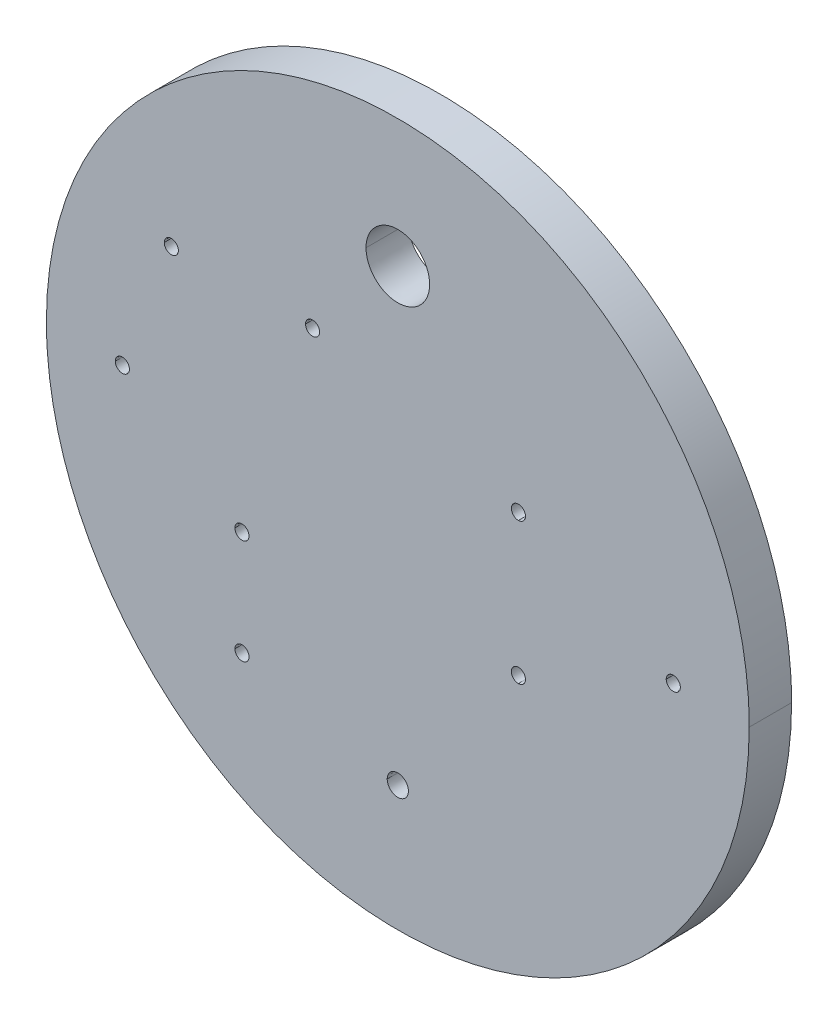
ISO-10303-21;
HEADER;
FILE_DESCRIPTION(('STEP AP214'),'2;1');
FILE_NAME('part.step','',(''),(''),'','','');
FILE_SCHEMA(('AUTOMOTIVE_DESIGN { 1 0 10303 214 1 1 1 1 }'));
ENDSEC;
DATA;
#1=APPLICATION_CONTEXT('core data for automotive mechanical design processes');
#2=APPLICATION_PROTOCOL_DEFINITION('international standard','automotive_design',2000,#1);
#3=PRODUCT_CONTEXT('',#1,'mechanical');
#4=PRODUCT('Part','Part','',(#3));
#5=PRODUCT_RELATED_PRODUCT_CATEGORY('part','',(#4));
#6=PRODUCT_DEFINITION_FORMATION('','',#4);
#7=PRODUCT_DEFINITION_CONTEXT('part definition',#1,'design');
#8=PRODUCT_DEFINITION('design','',#6,#7);
#9=PRODUCT_DEFINITION_SHAPE('','',#8);
#10=(LENGTH_UNIT() NAMED_UNIT(*) SI_UNIT(.MILLI.,.METRE.));
#11=(NAMED_UNIT(*) PLANE_ANGLE_UNIT() SI_UNIT($,.RADIAN.));
#12=(NAMED_UNIT(*) SI_UNIT($,.STERADIAN.) SOLID_ANGLE_UNIT());
#13=UNCERTAINTY_MEASURE_WITH_UNIT(LENGTH_MEASURE(1.E-05),#10,'distance_accuracy_value','');
#14=(GEOMETRIC_REPRESENTATION_CONTEXT(3) GLOBAL_UNCERTAINTY_ASSIGNED_CONTEXT((#13)) GLOBAL_UNIT_ASSIGNED_CONTEXT((#10,
#11,#12)) REPRESENTATION_CONTEXT('',''));
#15=CARTESIAN_POINT('',(0.,0.,0.));
#16=DIRECTION('',(0.,0.,1.));
#17=DIRECTION('',(1.,0.,0.));
#18=AXIS2_PLACEMENT_3D('',#15,#16,#17);
#19=CARTESIAN_POINT('',(1500.72484530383,279.058736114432,6.));
#20=CARTESIAN_POINT('',(1500.72484530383,279.611020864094,6.));
#21=CARTESIAN_POINT('',(1501.17256055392,280.058736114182,6.));
#22=CARTESIAN_POINT('',(1502.27713005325,280.058736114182,6.));
#23=CARTESIAN_POINT('',(1502.72484530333,279.611020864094,6.));
#24=CARTESIAN_POINT('',(1502.72484530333,279.058736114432,6.));
#25=B_SPLINE_CURVE_WITH_KNOTS('',3,(#19,#20,#21,#22,#23,#24),.UNSPECIFIED.,.F.,.F.,(4,2,4),(2.,
3.,4.),.UNSPECIFIED.);
#26=DIRECTION('',(0.,0.,-1.));
#27=VECTOR('',#26,1.);
#28=SURFACE_OF_LINEAR_EXTRUSION('',#25,#27);
#29=CARTESIAN_POINT('',(1500.72484530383,279.058736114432,0.));
#30=CARTESIAN_POINT('',(1500.72484530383,279.611020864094,0.));
#31=CARTESIAN_POINT('',(1501.17256055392,280.058736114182,0.));
#32=CARTESIAN_POINT('',(1502.27713005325,280.058736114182,0.));
#33=CARTESIAN_POINT('',(1502.72484530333,279.611020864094,0.));
#34=CARTESIAN_POINT('',(1502.72484530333,279.058736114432,0.));
#35=B_SPLINE_CURVE_WITH_KNOTS('',3,(#29,#30,#31,#32,#33,#34),.UNSPECIFIED.,.F.,.F.,(4,2,4),(2.,
3.,4.),.UNSPECIFIED.);
#36=CARTESIAN_POINT('',(1500.72484530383,279.058736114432,0.));
#37=VERTEX_POINT('',#36);
#38=CARTESIAN_POINT('',(1502.72484530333,279.058736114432,0.));
#39=VERTEX_POINT('',#38);
#40=EDGE_CURVE('E600',#37,#39,#35,.T.);
#41=ORIENTED_EDGE('',*,*,#40,.T.);
#42=DIRECTION('',(0.,0.,-1.));
#43=VECTOR('',#42,1.);
#44=CARTESIAN_POINT('',(1502.72484530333,279.058736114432,6.));
#45=LINE('',#44,#43);
#46=CARTESIAN_POINT('',(1502.72484530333,279.058736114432,6.));
#47=VERTEX_POINT('',#46);
#48=EDGE_CURVE('E11',#47,#39,#45,.T.);
#49=ORIENTED_EDGE('',*,*,#48,.F.);
#50=CARTESIAN_POINT('',(1500.72484530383,279.058736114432,6.));
#51=VERTEX_POINT('',#50);
#52=EDGE_CURVE('E200',#51,#47,#25,.T.);
#53=ORIENTED_EDGE('',*,*,#52,.F.);
#54=DIRECTION('',(0.,0.,-1.));
#55=VECTOR('',#54,1.);
#56=CARTESIAN_POINT('',(1500.72484530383,279.058736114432,6.));
#57=LINE('',#56,#55);
#58=EDGE_CURVE('E47',#51,#37,#57,.T.);
#59=ORIENTED_EDGE('',*,*,#58,.T.);
#60=EDGE_LOOP('',(#41,#49,#53,#59));
#61=FACE_BOUND('',#60,.T.);
#62=ADVANCED_FACE('F36',(#61),#28,.F.);
#63=CARTESIAN_POINT('',(1578.72484528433,279.058736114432,6.));
#64=CARTESIAN_POINT('',(1578.72484528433,279.611020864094,6.));
#65=CARTESIAN_POINT('',(1579.17256053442,280.058736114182,6.));
#66=CARTESIAN_POINT('',(1580.27713003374,280.058736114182,6.));
#67=CARTESIAN_POINT('',(1580.72484528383,279.611020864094,6.));
#68=CARTESIAN_POINT('',(1580.72484528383,279.058736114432,6.));
#69=B_SPLINE_CURVE_WITH_KNOTS('',3,(#63,#64,#65,#66,#67,#68),.UNSPECIFIED.,.F.,.F.,(4,2,4),(2.,
3.,4.),.UNSPECIFIED.);
#70=DIRECTION('',(0.,0.,-1.));
#71=VECTOR('',#70,1.);
#72=SURFACE_OF_LINEAR_EXTRUSION('',#69,#71);
#73=CARTESIAN_POINT('',(1578.72484528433,279.058736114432,0.));
#74=CARTESIAN_POINT('',(1578.72484528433,279.611020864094,0.));
#75=CARTESIAN_POINT('',(1579.17256053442,280.058736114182,0.));
#76=CARTESIAN_POINT('',(1580.27713003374,280.058736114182,0.));
#77=CARTESIAN_POINT('',(1580.72484528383,279.611020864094,0.));
#78=CARTESIAN_POINT('',(1580.72484528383,279.058736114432,0.));
#79=B_SPLINE_CURVE_WITH_KNOTS('',3,(#73,#74,#75,#76,#77,#78),.UNSPECIFIED.,.F.,.F.,(4,2,4),(2.,
3.,4.),.UNSPECIFIED.);
#80=CARTESIAN_POINT('',(1578.72484528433,279.058736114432,0.));
#81=VERTEX_POINT('',#80);
#82=CARTESIAN_POINT('',(1580.72484528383,279.058736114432,0.));
#83=VERTEX_POINT('',#82);
#84=EDGE_CURVE('E587',#81,#83,#79,.T.);
#85=ORIENTED_EDGE('',*,*,#84,.T.);
#86=DIRECTION('',(0.,0.,-1.));
#87=VECTOR('',#86,1.);
#88=CARTESIAN_POINT('',(1580.72484528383,279.058736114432,6.));
#89=LINE('',#88,#87);
#90=CARTESIAN_POINT('',(1580.72484528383,279.058736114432,6.));
#91=VERTEX_POINT('',#90);
#92=EDGE_CURVE('E209',#91,#83,#89,.T.);
#93=ORIENTED_EDGE('',*,*,#92,.F.);
#94=CARTESIAN_POINT('',(1578.72484528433,279.058736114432,6.));
#95=VERTEX_POINT('',#94);
#96=EDGE_CURVE('E196',#95,#91,#69,.T.);
#97=ORIENTED_EDGE('',*,*,#96,.F.);
#98=DIRECTION('',(0.,0.,-1.));
#99=VECTOR('',#98,1.);
#100=CARTESIAN_POINT('',(1578.72484528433,279.058736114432,6.));
#101=LINE('',#100,#99);
#102=EDGE_CURVE('E203',#95,#81,#101,.T.);
#103=ORIENTED_EDGE('',*,*,#102,.T.);
#104=EDGE_LOOP('',(#85,#93,#97,#103));
#105=FACE_BOUND('',#104,.T.);
#106=ADVANCED_FACE('F212',(#105),#72,.F.);
#107=CARTESIAN_POINT('',(1536.22484529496,310.70896219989,6.));
#108=CARTESIAN_POINT('',(1536.22484529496,313.194243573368,6.));
#109=CARTESIAN_POINT('',(1538.23956392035,315.208962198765,6.));
#110=CARTESIAN_POINT('',(1543.21012666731,315.208962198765,6.));
#111=CARTESIAN_POINT('',(1545.22484529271,313.194243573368,6.));
#112=CARTESIAN_POINT('',(1545.22484529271,310.70896219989,6.));
#113=B_SPLINE_CURVE_WITH_KNOTS('',3,(#107,#108,#109,#110,#111,#112),.UNSPECIFIED.,.F.,.F.,(4,2,
4),(2.,3.,4.),.UNSPECIFIED.);
#114=DIRECTION('',(0.,0.,-1.));
#115=VECTOR('',#114,1.);
#116=SURFACE_OF_LINEAR_EXTRUSION('',#113,#115);
#117=CARTESIAN_POINT('',(1536.22484529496,310.70896219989,0.));
#118=CARTESIAN_POINT('',(1536.22484529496,313.194243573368,0.));
#119=CARTESIAN_POINT('',(1538.23956392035,315.208962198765,0.));
#120=CARTESIAN_POINT('',(1543.21012666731,315.208962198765,0.));
#121=CARTESIAN_POINT('',(1545.22484529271,313.194243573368,0.));
#122=CARTESIAN_POINT('',(1545.22484529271,310.70896219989,0.));
#123=B_SPLINE_CURVE_WITH_KNOTS('',3,(#117,#118,#119,#120,#121,#122),.UNSPECIFIED.,.F.,.F.,(4,2,
4),(2.,3.,4.),.UNSPECIFIED.);
#124=CARTESIAN_POINT('',(1536.22484529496,310.70896219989,0.));
#125=VERTEX_POINT('',#124);
#126=CARTESIAN_POINT('',(1545.22484529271,310.70896219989,0.));
#127=VERTEX_POINT('',#126);
#128=EDGE_CURVE('E572',#125,#127,#123,.T.);
#129=ORIENTED_EDGE('',*,*,#128,.T.);
#130=DIRECTION('',(0.,0.,-1.));
#131=VECTOR('',#130,1.);
#132=CARTESIAN_POINT('',(1545.22484529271,310.70896219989,6.));
#133=LINE('',#132,#131);
#134=CARTESIAN_POINT('',(1545.22484529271,310.70896219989,6.));
#135=VERTEX_POINT('',#134);
#136=EDGE_CURVE('E210',#135,#127,#133,.T.);
#137=ORIENTED_EDGE('',*,*,#136,.F.);
#138=CARTESIAN_POINT('',(1536.22484529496,310.70896219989,6.));
#139=VERTEX_POINT('',#138);
#140=EDGE_CURVE('E215',#139,#135,#113,.T.);
#141=ORIENTED_EDGE('',*,*,#140,.F.);
#142=DIRECTION('',(0.,0.,-1.));
#143=VECTOR('',#142,1.);
#144=CARTESIAN_POINT('',(1536.22484529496,310.70896219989,6.));
#145=LINE('',#144,#143);
#146=EDGE_CURVE('E619',#139,#125,#145,.T.);
#147=ORIENTED_EDGE('',*,*,#146,.T.);
#148=EDGE_LOOP('',(#129,#137,#141,#147));
#149=FACE_BOUND('',#148,.T.);
#150=ADVANCED_FACE('F235',(#149),#116,.F.);
#151=CARTESIAN_POINT('',(1539.22484529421,247.073550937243,6.));
#152=CARTESIAN_POINT('',(1539.22484529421,247.901978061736,6.));
#153=CARTESIAN_POINT('',(1539.89641816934,248.573550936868,6.));
#154=CARTESIAN_POINT('',(1541.55327241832,248.573550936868,6.));
#155=CARTESIAN_POINT('',(1542.22484529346,247.901978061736,6.));
#156=CARTESIAN_POINT('',(1542.22484529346,247.073550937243,6.));
#157=B_SPLINE_CURVE_WITH_KNOTS('',3,(#151,#152,#153,#154,#155,#156),.UNSPECIFIED.,.F.,.F.,(4,2,
4),(2.,3.,4.),.UNSPECIFIED.);
#158=DIRECTION('',(0.,0.,-1.));
#159=VECTOR('',#158,1.);
#160=SURFACE_OF_LINEAR_EXTRUSION('',#157,#159);
#161=CARTESIAN_POINT('',(1539.22484529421,247.073550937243,0.));
#162=CARTESIAN_POINT('',(1539.22484529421,247.901978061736,0.));
#163=CARTESIAN_POINT('',(1539.89641816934,248.573550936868,0.));
#164=CARTESIAN_POINT('',(1541.55327241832,248.573550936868,0.));
#165=CARTESIAN_POINT('',(1542.22484529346,247.901978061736,0.));
#166=CARTESIAN_POINT('',(1542.22484529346,247.073550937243,0.));
#167=B_SPLINE_CURVE_WITH_KNOTS('',3,(#161,#162,#163,#164,#165,#166),.UNSPECIFIED.,.F.,.F.,(4,2,
4),(2.,3.,4.),.UNSPECIFIED.);
#168=CARTESIAN_POINT('',(1539.22484529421,247.073550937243,0.));
#169=VERTEX_POINT('',#168);
#170=CARTESIAN_POINT('',(1542.22484529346,247.073550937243,0.));
#171=VERTEX_POINT('',#170);
#172=EDGE_CURVE('E557',#169,#171,#167,.T.);
#173=ORIENTED_EDGE('',*,*,#172,.T.);
#174=DIRECTION('',(0.,0.,-1.));
#175=VECTOR('',#174,1.);
#176=CARTESIAN_POINT('',(1542.22484529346,247.073550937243,6.));
#177=LINE('',#176,#175);
#178=CARTESIAN_POINT('',(1542.22484529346,247.073550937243,6.));
#179=VERTEX_POINT('',#178);
#180=EDGE_CURVE('E622',#179,#171,#177,.T.);
#181=ORIENTED_EDGE('',*,*,#180,.F.);
#182=CARTESIAN_POINT('',(1539.22484529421,247.073550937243,6.));
#183=VERTEX_POINT('',#182);
#184=EDGE_CURVE('E260',#183,#179,#157,.T.);
#185=ORIENTED_EDGE('',*,*,#184,.F.);
#186=DIRECTION('',(0.,0.,-1.));
#187=VECTOR('',#186,1.);
#188=CARTESIAN_POINT('',(1539.22484529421,247.073550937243,6.));
#189=LINE('',#188,#187);
#190=EDGE_CURVE('E625',#183,#169,#189,.T.);
#191=ORIENTED_EDGE('',*,*,#190,.T.);
#192=EDGE_LOOP('',(#173,#181,#185,#191));
#193=FACE_BOUND('',#192,.T.);
#194=ADVANCED_FACE('F244',(#193),#160,.F.);
#195=CARTESIAN_POINT('',(1557.79891936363,268.058736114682,6.));
#196=CARTESIAN_POINT('',(1558.3512041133,268.058736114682,6.));
#197=CARTESIAN_POINT('',(1558.79891936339,268.50645136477,6.));
#198=CARTESIAN_POINT('',(1558.79891936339,269.611020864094,6.));
#199=CARTESIAN_POINT('',(1558.3512041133,270.058736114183,6.));
#200=CARTESIAN_POINT('',(1557.79891936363,270.058736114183,6.));
#201=B_SPLINE_CURVE_WITH_KNOTS('',3,(#195,#196,#197,#198,#199,#200),.UNSPECIFIED.,.F.,.F.,(4,2,
4),(0.,1.,2.),.UNSPECIFIED.);
#202=DIRECTION('',(0.,0.,-1.));
#203=VECTOR('',#202,1.);
#204=SURFACE_OF_LINEAR_EXTRUSION('',#201,#203);
#205=CARTESIAN_POINT('',(1557.79891936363,268.058736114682,0.));
#206=CARTESIAN_POINT('',(1558.3512041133,268.058736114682,0.));
#207=CARTESIAN_POINT('',(1558.79891936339,268.50645136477,0.));
#208=CARTESIAN_POINT('',(1558.79891936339,269.611020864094,0.));
#209=CARTESIAN_POINT('',(1558.3512041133,270.058736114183,0.));
#210=CARTESIAN_POINT('',(1557.79891936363,270.058736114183,0.));
#211=B_SPLINE_CURVE_WITH_KNOTS('',3,(#205,#206,#207,#208,#209,#210),.UNSPECIFIED.,.F.,.F.,(4,2,
4),(0.,1.,2.),.UNSPECIFIED.);
#212=CARTESIAN_POINT('',(1557.79891936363,268.058736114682,0.));
#213=VERTEX_POINT('',#212);
#214=CARTESIAN_POINT('',(1557.79891936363,270.058736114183,0.));
#215=VERTEX_POINT('',#214);
#216=EDGE_CURVE('E541',#213,#215,#211,.T.);
#217=ORIENTED_EDGE('',*,*,#216,.F.);
#218=DIRECTION('',(0.,0.,-1.));
#219=VECTOR('',#218,1.);
#220=CARTESIAN_POINT('',(1557.79891936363,268.058736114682,6.));
#221=LINE('',#220,#219);
#222=CARTESIAN_POINT('',(1557.79891936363,268.058736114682,6.));
#223=VERTEX_POINT('',#222);
#224=EDGE_CURVE('E628',#223,#213,#221,.T.);
#225=ORIENTED_EDGE('',*,*,#224,.F.);
#226=CARTESIAN_POINT('',(1557.79891936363,270.058736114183,6.));
#227=VERTEX_POINT('',#226);
#228=EDGE_CURVE('E292',#223,#227,#201,.T.);
#229=ORIENTED_EDGE('',*,*,#228,.T.);
#230=DIRECTION('',(0.,0.,-1.));
#231=VECTOR('',#230,1.);
#232=CARTESIAN_POINT('',(1557.79891936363,270.058736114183,6.));
#233=LINE('',#232,#231);
#234=EDGE_CURVE('E631',#227,#215,#233,.T.);
#235=ORIENTED_EDGE('',*,*,#234,.T.);
#236=EDGE_LOOP('',(#217,#225,#229,#235));
#237=FACE_BOUND('',#236,.T.);
#238=ADVANCED_FACE('F279',(#237),#204,.T.);
#239=CARTESIAN_POINT('',(1557.79891936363,288.058736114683,6.));
#240=CARTESIAN_POINT('',(1558.3512041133,288.058736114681,6.));
#241=CARTESIAN_POINT('',(1558.79891936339,288.506451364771,6.));
#242=CARTESIAN_POINT('',(1558.79891936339,289.611020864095,6.));
#243=CARTESIAN_POINT('',(1558.3512041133,290.058736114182,6.));
#244=CARTESIAN_POINT('',(1557.79891936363,290.058736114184,6.));
#245=B_SPLINE_CURVE_WITH_KNOTS('',3,(#239,#240,#241,#242,#243,#244),.UNSPECIFIED.,.F.,.F.,(4,2,
4),(0.,1.,2.),.UNSPECIFIED.);
#246=DIRECTION('',(0.,0.,-1.));
#247=VECTOR('',#246,1.);
#248=SURFACE_OF_LINEAR_EXTRUSION('',#245,#247);
#249=CARTESIAN_POINT('',(1557.79891936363,288.058736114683,0.));
#250=CARTESIAN_POINT('',(1558.3512041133,288.058736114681,0.));
#251=CARTESIAN_POINT('',(1558.79891936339,288.506451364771,0.));
#252=CARTESIAN_POINT('',(1558.79891936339,289.611020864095,0.));
#253=CARTESIAN_POINT('',(1558.3512041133,290.058736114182,0.));
#254=CARTESIAN_POINT('',(1557.79891936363,290.058736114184,0.));
#255=B_SPLINE_CURVE_WITH_KNOTS('',3,(#249,#250,#251,#252,#253,#254),.UNSPECIFIED.,.F.,.F.,(4,2,
4),(0.,1.,2.),.UNSPECIFIED.);
#256=CARTESIAN_POINT('',(1557.79891936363,288.058736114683,0.));
#257=VERTEX_POINT('',#256);
#258=CARTESIAN_POINT('',(1557.79891936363,290.058736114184,0.));
#259=VERTEX_POINT('',#258);
#260=EDGE_CURVE('E525',#257,#259,#255,.T.);
#261=ORIENTED_EDGE('',*,*,#260,.F.);
#262=DIRECTION('',(0.,0.,-1.));
#263=VECTOR('',#262,1.);
#264=CARTESIAN_POINT('',(1557.79891936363,288.058736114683,6.));
#265=LINE('',#264,#263);
#266=CARTESIAN_POINT('',(1557.79891936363,288.058736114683,6.));
#267=VERTEX_POINT('',#266);
#268=EDGE_CURVE('E633',#267,#257,#265,.T.);
#269=ORIENTED_EDGE('',*,*,#268,.F.);
#270=CARTESIAN_POINT('',(1557.79891936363,290.058736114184,6.));
#271=VERTEX_POINT('',#270);
#272=EDGE_CURVE('E306',#267,#271,#245,.T.);
#273=ORIENTED_EDGE('',*,*,#272,.T.);
#274=DIRECTION('',(0.,0.,-1.));
#275=VECTOR('',#274,1.);
#276=CARTESIAN_POINT('',(1557.79891936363,290.058736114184,6.));
#277=LINE('',#276,#275);
#278=EDGE_CURVE('E635',#271,#259,#277,.T.);
#279=ORIENTED_EDGE('',*,*,#278,.T.);
#280=EDGE_LOOP('',(#261,#269,#273,#279));
#281=FACE_BOUND('',#280,.T.);
#282=ADVANCED_FACE('F288',(#281),#248,.T.);
#283=CARTESIAN_POINT('',(1519.65817863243,267.07069060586,6.));
#284=CARTESIAN_POINT('',(1519.65817863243,267.622975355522,6.));
#285=CARTESIAN_POINT('',(1519.21046338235,268.070690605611,6.));
#286=CARTESIAN_POINT('',(1518.10589388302,268.070690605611,6.));
#287=CARTESIAN_POINT('',(1517.65817863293,267.622975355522,6.));
#288=CARTESIAN_POINT('',(1517.65817863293,267.07069060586,6.));
#289=B_SPLINE_CURVE_WITH_KNOTS('',3,(#283,#284,#285,#286,#287,#288),.UNSPECIFIED.,.F.,.F.,(4,2,
4),(0.,1.,2.),.UNSPECIFIED.);
#290=DIRECTION('',(0.,0.,-1.));
#291=VECTOR('',#290,1.);
#292=SURFACE_OF_LINEAR_EXTRUSION('',#289,#291);
#293=CARTESIAN_POINT('',(1519.65817863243,267.07069060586,0.));
#294=CARTESIAN_POINT('',(1519.65817863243,267.622975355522,0.));
#295=CARTESIAN_POINT('',(1519.21046338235,268.070690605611,0.));
#296=CARTESIAN_POINT('',(1518.10589388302,268.070690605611,0.));
#297=CARTESIAN_POINT('',(1517.65817863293,267.622975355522,0.));
#298=CARTESIAN_POINT('',(1517.65817863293,267.07069060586,0.));
#299=B_SPLINE_CURVE_WITH_KNOTS('',3,(#293,#294,#295,#296,#297,#298),.UNSPECIFIED.,.F.,.F.,(4,2,
4),(0.,1.,2.),.UNSPECIFIED.);
#300=CARTESIAN_POINT('',(1519.65817863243,267.07069060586,0.));
#301=VERTEX_POINT('',#300);
#302=CARTESIAN_POINT('',(1517.65817863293,267.07069060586,0.));
#303=VERTEX_POINT('',#302);
#304=EDGE_CURVE('E509',#301,#303,#299,.T.);
#305=ORIENTED_EDGE('',*,*,#304,.F.);
#306=DIRECTION('',(0.,0.,-1.));
#307=VECTOR('',#306,1.);
#308=CARTESIAN_POINT('',(1519.65817863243,267.07069060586,6.));
#309=LINE('',#308,#307);
#310=CARTESIAN_POINT('',(1519.65817863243,267.07069060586,6.));
#311=VERTEX_POINT('',#310);
#312=EDGE_CURVE('E637',#311,#301,#309,.T.);
#313=ORIENTED_EDGE('',*,*,#312,.F.);
#314=CARTESIAN_POINT('',(1517.65817863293,267.07069060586,6.));
#315=VERTEX_POINT('',#314);
#316=EDGE_CURVE('E338',#311,#315,#289,.T.);
#317=ORIENTED_EDGE('',*,*,#316,.T.);
#318=DIRECTION('',(0.,0.,-1.));
#319=VECTOR('',#318,1.);
#320=CARTESIAN_POINT('',(1517.65817863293,267.07069060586,6.));
#321=LINE('',#320,#319);
#322=EDGE_CURVE('E639',#315,#303,#321,.T.);
#323=ORIENTED_EDGE('',*,*,#322,.T.);
#324=EDGE_LOOP('',(#305,#313,#317,#323));
#325=FACE_BOUND('',#324,.T.);
#326=ADVANCED_FACE('F325',(#325),#292,.T.);
#327=CARTESIAN_POINT('',(1529.65817863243,297.07069060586,6.));
#328=CARTESIAN_POINT('',(1529.65817863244,297.622975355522,6.));
#329=CARTESIAN_POINT('',(1529.21046338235,298.07069060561,6.));
#330=CARTESIAN_POINT('',(1528.10589388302,298.07069060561,6.));
#331=CARTESIAN_POINT('',(1527.65817863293,297.622975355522,6.));
#332=CARTESIAN_POINT('',(1527.65817863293,297.07069060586,6.));
#333=B_SPLINE_CURVE_WITH_KNOTS('',3,(#327,#328,#329,#330,#331,#332),.UNSPECIFIED.,.F.,.F.,(4,2,
4),(0.,1.,2.),.UNSPECIFIED.);
#334=DIRECTION('',(0.,0.,-1.));
#335=VECTOR('',#334,1.);
#336=SURFACE_OF_LINEAR_EXTRUSION('',#333,#335);
#337=CARTESIAN_POINT('',(1529.65817863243,297.07069060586,0.));
#338=CARTESIAN_POINT('',(1529.65817863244,297.622975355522,0.));
#339=CARTESIAN_POINT('',(1529.21046338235,298.07069060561,0.));
#340=CARTESIAN_POINT('',(1528.10589388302,298.07069060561,0.));
#341=CARTESIAN_POINT('',(1527.65817863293,297.622975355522,0.));
#342=CARTESIAN_POINT('',(1527.65817863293,297.07069060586,0.));
#343=B_SPLINE_CURVE_WITH_KNOTS('',3,(#337,#338,#339,#340,#341,#342),.UNSPECIFIED.,.F.,.F.,(4,2,
4),(0.,1.,2.),.UNSPECIFIED.);
#344=CARTESIAN_POINT('',(1529.65817863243,297.07069060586,0.));
#345=VERTEX_POINT('',#344);
#346=CARTESIAN_POINT('',(1527.65817863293,297.07069060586,0.));
#347=VERTEX_POINT('',#346);
#348=EDGE_CURVE('E493',#345,#347,#343,.T.);
#349=ORIENTED_EDGE('',*,*,#348,.F.);
#350=DIRECTION('',(0.,0.,-1.));
#351=VECTOR('',#350,1.);
#352=CARTESIAN_POINT('',(1529.65817863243,297.07069060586,6.));
#353=LINE('',#352,#351);
#354=CARTESIAN_POINT('',(1529.65817863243,297.07069060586,6.));
#355=VERTEX_POINT('',#354);
#356=EDGE_CURVE('E641',#355,#345,#353,.T.);
#357=ORIENTED_EDGE('',*,*,#356,.F.);
#358=CARTESIAN_POINT('',(1527.65817863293,297.07069060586,6.));
#359=VERTEX_POINT('',#358);
#360=EDGE_CURVE('E352',#355,#359,#333,.T.);
#361=ORIENTED_EDGE('',*,*,#360,.T.);
#362=DIRECTION('',(0.,0.,-1.));
#363=VECTOR('',#362,1.);
#364=CARTESIAN_POINT('',(1527.65817863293,297.07069060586,6.));
#365=LINE('',#364,#363);
#366=EDGE_CURVE('E643',#359,#347,#365,.T.);
#367=ORIENTED_EDGE('',*,*,#366,.T.);
#368=EDGE_LOOP('',(#349,#357,#361,#367));
#369=FACE_BOUND('',#368,.T.);
#370=ADVANCED_FACE('F334',(#369),#336,.T.);
#371=CARTESIAN_POINT('',(1509.65817863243,297.07069060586,6.));
#372=CARTESIAN_POINT('',(1509.65817863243,297.622975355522,6.));
#373=CARTESIAN_POINT('',(1509.21046338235,298.07069060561,6.));
#374=CARTESIAN_POINT('',(1508.10589388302,298.07069060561,6.));
#375=CARTESIAN_POINT('',(1507.65817863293,297.622975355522,6.));
#376=CARTESIAN_POINT('',(1507.65817863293,297.07069060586,6.));
#377=B_SPLINE_CURVE_WITH_KNOTS('',3,(#371,#372,#373,#374,#375,#376),.UNSPECIFIED.,.F.,.F.,(4,2,
4),(0.,1.,2.),.UNSPECIFIED.);
#378=DIRECTION('',(0.,0.,-1.));
#379=VECTOR('',#378,1.);
#380=SURFACE_OF_LINEAR_EXTRUSION('',#377,#379);
#381=CARTESIAN_POINT('',(1509.65817863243,297.07069060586,0.));
#382=CARTESIAN_POINT('',(1509.65817863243,297.622975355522,0.));
#383=CARTESIAN_POINT('',(1509.21046338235,298.07069060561,0.));
#384=CARTESIAN_POINT('',(1508.10589388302,298.07069060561,0.));
#385=CARTESIAN_POINT('',(1507.65817863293,297.622975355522,0.));
#386=CARTESIAN_POINT('',(1507.65817863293,297.07069060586,0.));
#387=B_SPLINE_CURVE_WITH_KNOTS('',3,(#381,#382,#383,#384,#385,#386),.UNSPECIFIED.,.F.,.F.,(4,2,
4),(0.,1.,2.),.UNSPECIFIED.);
#388=CARTESIAN_POINT('',(1509.65817863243,297.07069060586,0.));
#389=VERTEX_POINT('',#388);
#390=CARTESIAN_POINT('',(1507.65817863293,297.07069060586,0.));
#391=VERTEX_POINT('',#390);
#392=EDGE_CURVE('E477',#389,#391,#387,.T.);
#393=ORIENTED_EDGE('',*,*,#392,.F.);
#394=DIRECTION('',(0.,0.,-1.));
#395=VECTOR('',#394,1.);
#396=CARTESIAN_POINT('',(1509.65817863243,297.07069060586,6.));
#397=LINE('',#396,#395);
#398=CARTESIAN_POINT('',(1509.65817863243,297.07069060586,6.));
#399=VERTEX_POINT('',#398);
#400=EDGE_CURVE('E645',#399,#389,#397,.T.);
#401=ORIENTED_EDGE('',*,*,#400,.F.);
#402=CARTESIAN_POINT('',(1507.65817863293,297.07069060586,6.));
#403=VERTEX_POINT('',#402);
#404=EDGE_CURVE('E384',#399,#403,#377,.T.);
#405=ORIENTED_EDGE('',*,*,#404,.T.);
#406=DIRECTION('',(0.,0.,-1.));
#407=VECTOR('',#406,1.);
#408=CARTESIAN_POINT('',(1507.65817863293,297.07069060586,6.));
#409=LINE('',#408,#407);
#410=EDGE_CURVE('E647',#403,#391,#409,.T.);
#411=ORIENTED_EDGE('',*,*,#410,.T.);
#412=EDGE_LOOP('',(#393,#401,#405,#411));
#413=FACE_BOUND('',#412,.T.);
#414=ADVANCED_FACE('F371',(#413),#380,.T.);
#415=CARTESIAN_POINT('',(1590.47484528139,279.058736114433,6.));
#416=CARTESIAN_POINT('',(1590.47484528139,251.582569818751,6.));
#417=CARTESIAN_POINT('',(1568.20101158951,229.30873612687,6.));
#418=CARTESIAN_POINT('',(1513.24867899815,229.30873612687,6.));
#419=CARTESIAN_POINT('',(1490.97484530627,251.582569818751,6.));
#420=CARTESIAN_POINT('',(1490.97484530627,279.058736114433,6.));
#421=B_SPLINE_CURVE_WITH_KNOTS('',3,(#415,#416,#417,#418,#419,#420),.UNSPECIFIED.,.F.,.F.,(4,2,
4),(0.,1.,2.),.UNSPECIFIED.);
#422=DIRECTION('',(0.,0.,-1.));
#423=VECTOR('',#422,1.);
#424=SURFACE_OF_LINEAR_EXTRUSION('',#421,#423);
#425=CARTESIAN_POINT('',(1590.47484528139,279.058736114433,0.));
#426=CARTESIAN_POINT('',(1590.47484528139,251.582569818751,0.));
#427=CARTESIAN_POINT('',(1568.20101158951,229.30873612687,0.));
#428=CARTESIAN_POINT('',(1513.24867899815,229.30873612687,0.));
#429=CARTESIAN_POINT('',(1490.97484530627,251.582569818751,0.));
#430=CARTESIAN_POINT('',(1490.97484530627,279.058736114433,0.));
#431=B_SPLINE_CURVE_WITH_KNOTS('',3,(#425,#426,#427,#428,#429,#430),.UNSPECIFIED.,.F.,.F.,(4,2,
4),(0.,1.,2.),.UNSPECIFIED.);
#432=CARTESIAN_POINT('',(1590.47484528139,279.058736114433,0.));
#433=VERTEX_POINT('',#432);
#434=CARTESIAN_POINT('',(1490.97484530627,279.058736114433,0.));
#435=VERTEX_POINT('',#434);
#436=EDGE_CURVE('E461',#433,#435,#431,.T.);
#437=ORIENTED_EDGE('',*,*,#436,.F.);
#438=DIRECTION('',(0.,0.,-1.));
#439=VECTOR('',#438,1.);
#440=CARTESIAN_POINT('',(1590.47484528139,279.058736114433,6.));
#441=LINE('',#440,#439);
#442=CARTESIAN_POINT('',(1590.47484528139,279.058736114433,6.));
#443=VERTEX_POINT('',#442);
#444=EDGE_CURVE('E649',#443,#433,#441,.T.);
#445=ORIENTED_EDGE('',*,*,#444,.F.);
#446=CARTESIAN_POINT('',(1490.97484530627,279.058736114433,6.));
#447=VERTEX_POINT('',#446);
#448=EDGE_CURVE('E398',#443,#447,#421,.T.);
#449=ORIENTED_EDGE('',*,*,#448,.T.);
#450=DIRECTION('',(0.,0.,-1.));
#451=VECTOR('',#450,1.);
#452=CARTESIAN_POINT('',(1490.97484530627,279.058736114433,6.));
#453=LINE('',#452,#451);
#454=EDGE_CURVE('E651',#447,#435,#453,.T.);
#455=ORIENTED_EDGE('',*,*,#454,.T.);
#456=EDGE_LOOP('',(#437,#445,#449,#455));
#457=FACE_BOUND('',#456,.T.);
#458=ADVANCED_FACE('F380',(#457),#424,.T.);
#459=CARTESIAN_POINT('',(1519.65817863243,252.254023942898,6.));
#460=CARTESIAN_POINT('',(1519.65817863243,252.80630869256,6.));
#461=CARTESIAN_POINT('',(1519.21046338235,253.254023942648,6.));
#462=CARTESIAN_POINT('',(1518.10589388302,253.254023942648,6.));
#463=CARTESIAN_POINT('',(1517.65817863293,252.80630869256,6.));
#464=CARTESIAN_POINT('',(1517.65817863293,252.254023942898,6.));
#465=B_SPLINE_CURVE_WITH_KNOTS('',3,(#459,#460,#461,#462,#463,#464),.UNSPECIFIED.,.F.,.F.,(4,2,
4),(0.,1.,2.),.UNSPECIFIED.);
#466=DIRECTION('',(0.,0.,-1.));
#467=VECTOR('',#466,1.);
#468=SURFACE_OF_LINEAR_EXTRUSION('',#465,#467);
#469=CARTESIAN_POINT('',(1519.65817863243,252.254023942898,0.));
#470=CARTESIAN_POINT('',(1519.65817863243,252.80630869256,0.));
#471=CARTESIAN_POINT('',(1519.21046338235,253.254023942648,0.));
#472=CARTESIAN_POINT('',(1518.10589388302,253.254023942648,0.));
#473=CARTESIAN_POINT('',(1517.65817863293,252.80630869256,0.));
#474=CARTESIAN_POINT('',(1517.65817863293,252.254023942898,0.));
#475=B_SPLINE_CURVE_WITH_KNOTS('',3,(#469,#470,#471,#472,#473,#474),.UNSPECIFIED.,.F.,.F.,(4,2,
4),(0.,1.,2.),.UNSPECIFIED.);
#476=CARTESIAN_POINT('',(1519.65817863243,252.254023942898,0.));
#477=VERTEX_POINT('',#476);
#478=CARTESIAN_POINT('',(1517.65817863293,252.254023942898,0.));
#479=VERTEX_POINT('',#478);
#480=EDGE_CURVE('E445',#477,#479,#475,.T.);
#481=ORIENTED_EDGE('',*,*,#480,.F.);
#482=DIRECTION('',(0.,0.,-1.));
#483=VECTOR('',#482,1.);
#484=CARTESIAN_POINT('',(1519.65817863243,252.254023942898,6.));
#485=LINE('',#484,#483);
#486=CARTESIAN_POINT('',(1519.65817863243,252.254023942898,6.));
#487=VERTEX_POINT('',#486);
#488=EDGE_CURVE('E41',#487,#477,#485,.T.);
#489=ORIENTED_EDGE('',*,*,#488,.F.);
#490=CARTESIAN_POINT('',(1517.65817863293,252.254023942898,6.));
#491=VERTEX_POINT('',#490);
#492=EDGE_CURVE('E613',#487,#491,#465,.T.);
#493=ORIENTED_EDGE('',*,*,#492,.T.);
#494=DIRECTION('',(0.,0.,-1.));
#495=VECTOR('',#494,1.);
#496=CARTESIAN_POINT('',(1517.65817863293,252.254023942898,6.));
#497=LINE('',#496,#495);
#498=EDGE_CURVE('E444',#491,#479,#497,.T.);
#499=ORIENTED_EDGE('',*,*,#498,.T.);
#500=EDGE_LOOP('',(#481,#489,#493,#499));
#501=FACE_BOUND('',#500,.T.);
#502=ADVANCED_FACE('F38',(#501),#468,.T.);
#503=CARTESIAN_POINT('',(1580.72484528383,279.058736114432,6.));
#504=CARTESIAN_POINT('',(1580.72484528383,278.50645136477,6.));
#505=CARTESIAN_POINT('',(1580.27713003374,278.058736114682,6.));
#506=CARTESIAN_POINT('',(1579.17256053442,278.058736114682,6.));
#507=CARTESIAN_POINT('',(1578.72484528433,278.50645136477,6.));
#508=CARTESIAN_POINT('',(1578.72484528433,279.058736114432,6.));
#509=B_SPLINE_CURVE_WITH_KNOTS('',3,(#503,#504,#505,#506,#507,#508),.UNSPECIFIED.,.F.,.F.,(4,2,
4),(0.,1.,2.),.UNSPECIFIED.);
#510=DIRECTION('',(0.,0.,-1.));
#511=VECTOR('',#510,1.);
#512=SURFACE_OF_LINEAR_EXTRUSION('',#509,#511);
#513=CARTESIAN_POINT('',(1580.72484528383,279.058736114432,0.));
#514=CARTESIAN_POINT('',(1580.72484528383,278.50645136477,0.));
#515=CARTESIAN_POINT('',(1580.27713003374,278.058736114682,0.));
#516=CARTESIAN_POINT('',(1579.17256053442,278.058736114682,0.));
#517=CARTESIAN_POINT('',(1578.72484528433,278.50645136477,0.));
#518=CARTESIAN_POINT('',(1578.72484528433,279.058736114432,0.));
#519=B_SPLINE_CURVE_WITH_KNOTS('',3,(#513,#514,#515,#516,#517,#518),.UNSPECIFIED.,.F.,.F.,(4,2,
4),(0.,1.,2.),.UNSPECIFIED.);
#520=EDGE_CURVE('E205',#83,#81,#519,.T.);
#521=ORIENTED_EDGE('',*,*,#520,.T.);
#522=ORIENTED_EDGE('',*,*,#102,.F.);
#523=EDGE_CURVE('E192',#91,#95,#509,.T.);
#524=ORIENTED_EDGE('',*,*,#523,.F.);
#525=ORIENTED_EDGE('',*,*,#92,.T.);
#526=EDGE_LOOP('',(#521,#522,#524,#525));
#527=FACE_BOUND('',#526,.T.);
#528=ADVANCED_FACE('F204',(#527),#512,.F.);
#529=CARTESIAN_POINT('',(1545.22484529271,310.70896219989,6.));
#530=CARTESIAN_POINT('',(1545.22484529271,308.223680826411,6.));
#531=CARTESIAN_POINT('',(1543.21012666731,306.208962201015,6.));
#532=CARTESIAN_POINT('',(1538.23956392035,306.208962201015,6.));
#533=CARTESIAN_POINT('',(1536.22484529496,308.223680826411,6.));
#534=CARTESIAN_POINT('',(1536.22484529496,310.70896219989,6.));
#535=B_SPLINE_CURVE_WITH_KNOTS('',3,(#529,#530,#531,#532,#533,#534),.UNSPECIFIED.,.F.,.F.,(4,2,
4),(0.,1.,2.),.UNSPECIFIED.);
#536=DIRECTION('',(0.,0.,-1.));
#537=VECTOR('',#536,1.);
#538=SURFACE_OF_LINEAR_EXTRUSION('',#535,#537);
#539=CARTESIAN_POINT('',(1545.22484529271,310.70896219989,0.));
#540=CARTESIAN_POINT('',(1545.22484529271,308.223680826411,0.));
#541=CARTESIAN_POINT('',(1543.21012666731,306.208962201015,0.));
#542=CARTESIAN_POINT('',(1538.23956392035,306.208962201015,0.));
#543=CARTESIAN_POINT('',(1536.22484529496,308.223680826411,0.));
#544=CARTESIAN_POINT('',(1536.22484529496,310.70896219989,0.));
#545=B_SPLINE_CURVE_WITH_KNOTS('',3,(#539,#540,#541,#542,#543,#544),.UNSPECIFIED.,.F.,.F.,(4,2,
4),(0.,1.,2.),.UNSPECIFIED.);
#546=EDGE_CURVE('E580',#127,#125,#545,.T.);
#547=ORIENTED_EDGE('',*,*,#546,.T.);
#548=ORIENTED_EDGE('',*,*,#146,.F.);
#549=EDGE_CURVE('E213',#135,#139,#535,.T.);
#550=ORIENTED_EDGE('',*,*,#549,.F.);
#551=ORIENTED_EDGE('',*,*,#136,.T.);
#552=EDGE_LOOP('',(#547,#548,#550,#551));
#553=FACE_BOUND('',#552,.T.);
#554=ADVANCED_FACE('F237',(#553),#538,.F.);
#555=CARTESIAN_POINT('',(1542.22484529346,247.073550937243,6.));
#556=CARTESIAN_POINT('',(1542.22484529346,246.245123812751,6.));
#557=CARTESIAN_POINT('',(1541.55327241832,245.573550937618,6.));
#558=CARTESIAN_POINT('',(1539.89641816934,245.573550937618,6.));
#559=CARTESIAN_POINT('',(1539.22484529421,246.245123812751,6.));
#560=CARTESIAN_POINT('',(1539.22484529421,247.073550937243,6.));
#561=B_SPLINE_CURVE_WITH_KNOTS('',3,(#555,#556,#557,#558,#559,#560),.UNSPECIFIED.,.F.,.F.,(4,2,
4),(0.,1.,2.),.UNSPECIFIED.);
#562=DIRECTION('',(0.,0.,-1.));
#563=VECTOR('',#562,1.);
#564=SURFACE_OF_LINEAR_EXTRUSION('',#561,#563);
#565=CARTESIAN_POINT('',(1542.22484529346,247.073550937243,0.));
#566=CARTESIAN_POINT('',(1542.22484529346,246.245123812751,0.));
#567=CARTESIAN_POINT('',(1541.55327241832,245.573550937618,0.));
#568=CARTESIAN_POINT('',(1539.89641816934,245.573550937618,0.));
#569=CARTESIAN_POINT('',(1539.22484529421,246.245123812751,0.));
#570=CARTESIAN_POINT('',(1539.22484529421,247.073550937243,0.));
#571=B_SPLINE_CURVE_WITH_KNOTS('',3,(#565,#566,#567,#568,#569,#570),.UNSPECIFIED.,.F.,.F.,(4,2,
4),(0.,1.,2.),.UNSPECIFIED.);
#572=EDGE_CURVE('E565',#171,#169,#571,.T.);
#573=ORIENTED_EDGE('',*,*,#572,.T.);
#574=ORIENTED_EDGE('',*,*,#190,.F.);
#575=EDGE_CURVE('E252',#179,#183,#561,.T.);
#576=ORIENTED_EDGE('',*,*,#575,.F.);
#577=ORIENTED_EDGE('',*,*,#180,.T.);
#578=EDGE_LOOP('',(#573,#574,#576,#577));
#579=FACE_BOUND('',#578,.T.);
#580=ADVANCED_FACE('F240',(#579),#564,.F.);
#581=CARTESIAN_POINT('',(1557.79891936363,270.058736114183,6.));
#582=CARTESIAN_POINT('',(1557.24663461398,270.058736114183,6.));
#583=CARTESIAN_POINT('',(1556.79891936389,269.611020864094,6.));
#584=CARTESIAN_POINT('',(1556.79891936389,268.50645136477,6.));
#585=CARTESIAN_POINT('',(1557.24663461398,268.058736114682,6.));
#586=CARTESIAN_POINT('',(1557.79891936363,268.058736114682,6.));
#587=B_SPLINE_CURVE_WITH_KNOTS('',3,(#581,#582,#583,#584,#585,#586),.UNSPECIFIED.,.F.,.F.,(4,2,
4),(2.,3.,4.),.UNSPECIFIED.);
#588=DIRECTION('',(0.,0.,-1.));
#589=VECTOR('',#588,1.);
#590=SURFACE_OF_LINEAR_EXTRUSION('',#587,#589);
#591=CARTESIAN_POINT('',(1557.79891936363,270.058736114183,0.));
#592=CARTESIAN_POINT('',(1557.24663461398,270.058736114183,0.));
#593=CARTESIAN_POINT('',(1556.79891936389,269.611020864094,0.));
#594=CARTESIAN_POINT('',(1556.79891936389,268.50645136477,0.));
#595=CARTESIAN_POINT('',(1557.24663461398,268.058736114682,0.));
#596=CARTESIAN_POINT('',(1557.79891936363,268.058736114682,0.));
#597=B_SPLINE_CURVE_WITH_KNOTS('',3,(#591,#592,#593,#594,#595,#596),.UNSPECIFIED.,.F.,.F.,(4,2,
4),(2.,3.,4.),.UNSPECIFIED.);
#598=EDGE_CURVE('E549',#215,#213,#597,.T.);
#599=ORIENTED_EDGE('',*,*,#598,.F.);
#600=ORIENTED_EDGE('',*,*,#234,.F.);
#601=EDGE_CURVE('E269',#227,#223,#587,.T.);
#602=ORIENTED_EDGE('',*,*,#601,.T.);
#603=ORIENTED_EDGE('',*,*,#224,.T.);
#604=EDGE_LOOP('',(#599,#600,#602,#603));
#605=FACE_BOUND('',#604,.T.);
#606=ADVANCED_FACE('F281',(#605),#590,.T.);
#607=CARTESIAN_POINT('',(1557.79891936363,290.058736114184,6.));
#608=CARTESIAN_POINT('',(1557.24663461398,290.058736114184,6.));
#609=CARTESIAN_POINT('',(1556.79891936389,289.611020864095,6.));
#610=CARTESIAN_POINT('',(1556.79891936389,288.506451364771,6.));
#611=CARTESIAN_POINT('',(1557.24663461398,288.058736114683,6.));
#612=CARTESIAN_POINT('',(1557.79891936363,288.058736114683,6.));
#613=B_SPLINE_CURVE_WITH_KNOTS('',3,(#607,#608,#609,#610,#611,#612),.UNSPECIFIED.,.F.,.F.,(4,2,
4),(2.,3.,4.),.UNSPECIFIED.);
#614=DIRECTION('',(0.,0.,-1.));
#615=VECTOR('',#614,1.);
#616=SURFACE_OF_LINEAR_EXTRUSION('',#613,#615);
#617=CARTESIAN_POINT('',(1557.79891936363,290.058736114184,0.));
#618=CARTESIAN_POINT('',(1557.24663461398,290.058736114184,0.));
#619=CARTESIAN_POINT('',(1556.79891936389,289.611020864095,0.));
#620=CARTESIAN_POINT('',(1556.79891936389,288.506451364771,0.));
#621=CARTESIAN_POINT('',(1557.24663461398,288.058736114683,0.));
#622=CARTESIAN_POINT('',(1557.79891936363,288.058736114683,0.));
#623=B_SPLINE_CURVE_WITH_KNOTS('',3,(#617,#618,#619,#620,#621,#622),.UNSPECIFIED.,.F.,.F.,(4,2,
4),(2.,3.,4.),.UNSPECIFIED.);
#624=EDGE_CURVE('E533',#259,#257,#623,.T.);
#625=ORIENTED_EDGE('',*,*,#624,.F.);
#626=ORIENTED_EDGE('',*,*,#278,.F.);
#627=EDGE_CURVE('E297',#271,#267,#613,.T.);
#628=ORIENTED_EDGE('',*,*,#627,.T.);
#629=ORIENTED_EDGE('',*,*,#268,.T.);
#630=EDGE_LOOP('',(#625,#626,#628,#629));
#631=FACE_BOUND('',#630,.T.);
#632=ADVANCED_FACE('F284',(#631),#616,.T.);
#633=CARTESIAN_POINT('',(1517.65817863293,267.07069060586,6.));
#634=CARTESIAN_POINT('',(1517.65817863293,266.518405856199,6.));
#635=CARTESIAN_POINT('',(1518.10589388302,266.070690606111,6.));
#636=CARTESIAN_POINT('',(1519.21046338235,266.070690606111,6.));
#637=CARTESIAN_POINT('',(1519.65817863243,266.518405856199,6.));
#638=CARTESIAN_POINT('',(1519.65817863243,267.07069060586,6.));
#639=B_SPLINE_CURVE_WITH_KNOTS('',3,(#633,#634,#635,#636,#637,#638),.UNSPECIFIED.,.F.,.F.,(4,2,
4),(2.,3.,4.),.UNSPECIFIED.);
#640=DIRECTION('',(0.,0.,-1.));
#641=VECTOR('',#640,1.);
#642=SURFACE_OF_LINEAR_EXTRUSION('',#639,#641);
#643=CARTESIAN_POINT('',(1517.65817863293,267.07069060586,0.));
#644=CARTESIAN_POINT('',(1517.65817863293,266.518405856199,0.));
#645=CARTESIAN_POINT('',(1518.10589388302,266.070690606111,0.));
#646=CARTESIAN_POINT('',(1519.21046338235,266.070690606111,0.));
#647=CARTESIAN_POINT('',(1519.65817863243,266.518405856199,0.));
#648=CARTESIAN_POINT('',(1519.65817863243,267.07069060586,0.));
#649=B_SPLINE_CURVE_WITH_KNOTS('',3,(#643,#644,#645,#646,#647,#648),.UNSPECIFIED.,.F.,.F.,(4,2,
4),(2.,3.,4.),.UNSPECIFIED.);
#650=EDGE_CURVE('E517',#303,#301,#649,.T.);
#651=ORIENTED_EDGE('',*,*,#650,.F.);
#652=ORIENTED_EDGE('',*,*,#322,.F.);
#653=EDGE_CURVE('E315',#315,#311,#639,.T.);
#654=ORIENTED_EDGE('',*,*,#653,.T.);
#655=ORIENTED_EDGE('',*,*,#312,.T.);
#656=EDGE_LOOP('',(#651,#652,#654,#655));
#657=FACE_BOUND('',#656,.T.);
#658=ADVANCED_FACE('F327',(#657),#642,.T.);
#659=CARTESIAN_POINT('',(1527.65817863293,297.07069060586,6.));
#660=CARTESIAN_POINT('',(1527.65817863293,296.518405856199,6.));
#661=CARTESIAN_POINT('',(1528.10589388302,296.07069060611,6.));
#662=CARTESIAN_POINT('',(1529.21046338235,296.07069060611,6.));
#663=CARTESIAN_POINT('',(1529.65817863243,296.518405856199,6.));
#664=CARTESIAN_POINT('',(1529.65817863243,297.07069060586,6.));
#665=B_SPLINE_CURVE_WITH_KNOTS('',3,(#659,#660,#661,#662,#663,#664),.UNSPECIFIED.,.F.,.F.,(4,2,
4),(2.,3.,4.),.UNSPECIFIED.);
#666=DIRECTION('',(0.,0.,-1.));
#667=VECTOR('',#666,1.);
#668=SURFACE_OF_LINEAR_EXTRUSION('',#665,#667);
#669=CARTESIAN_POINT('',(1527.65817863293,297.07069060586,0.));
#670=CARTESIAN_POINT('',(1527.65817863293,296.518405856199,0.));
#671=CARTESIAN_POINT('',(1528.10589388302,296.07069060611,0.));
#672=CARTESIAN_POINT('',(1529.21046338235,296.07069060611,0.));
#673=CARTESIAN_POINT('',(1529.65817863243,296.518405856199,0.));
#674=CARTESIAN_POINT('',(1529.65817863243,297.07069060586,0.));
#675=B_SPLINE_CURVE_WITH_KNOTS('',3,(#669,#670,#671,#672,#673,#674),.UNSPECIFIED.,.F.,.F.,(4,2,
4),(2.,3.,4.),.UNSPECIFIED.);
#676=EDGE_CURVE('E501',#347,#345,#675,.T.);
#677=ORIENTED_EDGE('',*,*,#676,.F.);
#678=ORIENTED_EDGE('',*,*,#366,.F.);
#679=EDGE_CURVE('E343',#359,#355,#665,.T.);
#680=ORIENTED_EDGE('',*,*,#679,.T.);
#681=ORIENTED_EDGE('',*,*,#356,.T.);
#682=EDGE_LOOP('',(#677,#678,#680,#681));
#683=FACE_BOUND('',#682,.T.);
#684=ADVANCED_FACE('F330',(#683),#668,.T.);
#685=CARTESIAN_POINT('',(1507.65817863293,297.07069060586,6.));
#686=CARTESIAN_POINT('',(1507.65817863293,296.518405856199,6.));
#687=CARTESIAN_POINT('',(1508.10589388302,296.07069060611,6.));
#688=CARTESIAN_POINT('',(1509.21046338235,296.07069060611,6.));
#689=CARTESIAN_POINT('',(1509.65817863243,296.518405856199,6.));
#690=CARTESIAN_POINT('',(1509.65817863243,297.07069060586,6.));
#691=B_SPLINE_CURVE_WITH_KNOTS('',3,(#685,#686,#687,#688,#689,#690),.UNSPECIFIED.,.F.,.F.,(4,2,
4),(2.,3.,4.),.UNSPECIFIED.);
#692=DIRECTION('',(0.,0.,-1.));
#693=VECTOR('',#692,1.);
#694=SURFACE_OF_LINEAR_EXTRUSION('',#691,#693);
#695=CARTESIAN_POINT('',(1507.65817863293,297.07069060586,0.));
#696=CARTESIAN_POINT('',(1507.65817863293,296.518405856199,0.));
#697=CARTESIAN_POINT('',(1508.10589388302,296.07069060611,0.));
#698=CARTESIAN_POINT('',(1509.21046338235,296.07069060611,0.));
#699=CARTESIAN_POINT('',(1509.65817863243,296.518405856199,0.));
#700=CARTESIAN_POINT('',(1509.65817863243,297.07069060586,0.));
#701=B_SPLINE_CURVE_WITH_KNOTS('',3,(#695,#696,#697,#698,#699,#700),.UNSPECIFIED.,.F.,.F.,(4,2,
4),(2.,3.,4.),.UNSPECIFIED.);
#702=EDGE_CURVE('E485',#391,#389,#701,.T.);
#703=ORIENTED_EDGE('',*,*,#702,.F.);
#704=ORIENTED_EDGE('',*,*,#410,.F.);
#705=EDGE_CURVE('E361',#403,#399,#691,.T.);
#706=ORIENTED_EDGE('',*,*,#705,.T.);
#707=ORIENTED_EDGE('',*,*,#400,.T.);
#708=EDGE_LOOP('',(#703,#704,#706,#707));
#709=FACE_BOUND('',#708,.T.);
#710=ADVANCED_FACE('F373',(#709),#694,.T.);
#711=CARTESIAN_POINT('',(1490.97484530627,279.058736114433,6.));
#712=CARTESIAN_POINT('',(1490.97484530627,306.534902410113,6.));
#713=CARTESIAN_POINT('',(1513.24867899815,328.808736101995,6.));
#714=CARTESIAN_POINT('',(1568.20101158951,328.808736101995,6.));
#715=CARTESIAN_POINT('',(1590.47484528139,306.534902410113,6.));
#716=CARTESIAN_POINT('',(1590.47484528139,279.058736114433,6.));
#717=B_SPLINE_CURVE_WITH_KNOTS('',3,(#711,#712,#713,#714,#715,#716),.UNSPECIFIED.,.F.,.F.,(4,2,
4),(2.,3.,4.),.UNSPECIFIED.);
#718=DIRECTION('',(0.,0.,-1.));
#719=VECTOR('',#718,1.);
#720=SURFACE_OF_LINEAR_EXTRUSION('',#717,#719);
#721=CARTESIAN_POINT('',(1490.97484530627,279.058736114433,0.));
#722=CARTESIAN_POINT('',(1490.97484530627,306.534902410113,0.));
#723=CARTESIAN_POINT('',(1513.24867899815,328.808736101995,0.));
#724=CARTESIAN_POINT('',(1568.20101158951,328.808736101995,0.));
#725=CARTESIAN_POINT('',(1590.47484528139,306.534902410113,0.));
#726=CARTESIAN_POINT('',(1590.47484528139,279.058736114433,0.));
#727=B_SPLINE_CURVE_WITH_KNOTS('',3,(#721,#722,#723,#724,#725,#726),.UNSPECIFIED.,.F.,.F.,(4,2,
4),(2.,3.,4.),.UNSPECIFIED.);
#728=EDGE_CURVE('E469',#435,#433,#727,.T.);
#729=ORIENTED_EDGE('',*,*,#728,.F.);
#730=ORIENTED_EDGE('',*,*,#454,.F.);
#731=EDGE_CURVE('E389',#447,#443,#717,.T.);
#732=ORIENTED_EDGE('',*,*,#731,.T.);
#733=ORIENTED_EDGE('',*,*,#444,.T.);
#734=EDGE_LOOP('',(#729,#730,#732,#733));
#735=FACE_BOUND('',#734,.T.);
#736=ADVANCED_FACE('F376',(#735),#720,.T.);
#737=CARTESIAN_POINT('',(1517.65817863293,252.254023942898,6.));
#738=CARTESIAN_POINT('',(1517.65817863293,251.701739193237,6.));
#739=CARTESIAN_POINT('',(1518.10589388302,251.254023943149,6.));
#740=CARTESIAN_POINT('',(1519.21046338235,251.254023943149,6.));
#741=CARTESIAN_POINT('',(1519.65817863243,251.701739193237,6.));
#742=CARTESIAN_POINT('',(1519.65817863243,252.254023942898,6.));
#743=B_SPLINE_CURVE_WITH_KNOTS('',3,(#737,#738,#739,#740,#741,#742),.UNSPECIFIED.,.F.,.F.,(4,2,
4),(2.,3.,4.),.UNSPECIFIED.);
#744=DIRECTION('',(0.,0.,-1.));
#745=VECTOR('',#744,1.);
#746=SURFACE_OF_LINEAR_EXTRUSION('',#743,#745);
#747=CARTESIAN_POINT('',(1517.65817863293,252.254023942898,0.));
#748=CARTESIAN_POINT('',(1517.65817863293,251.701739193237,0.));
#749=CARTESIAN_POINT('',(1518.10589388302,251.254023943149,0.));
#750=CARTESIAN_POINT('',(1519.21046338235,251.254023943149,0.));
#751=CARTESIAN_POINT('',(1519.65817863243,251.701739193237,0.));
#752=CARTESIAN_POINT('',(1519.65817863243,252.254023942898,0.));
#753=B_SPLINE_CURVE_WITH_KNOTS('',3,(#747,#748,#749,#750,#751,#752),.UNSPECIFIED.,.F.,.F.,(4,2,
4),(2.,3.,4.),.UNSPECIFIED.);
#754=EDGE_CURVE('E453',#479,#477,#753,.T.);
#755=ORIENTED_EDGE('',*,*,#754,.F.);
#756=ORIENTED_EDGE('',*,*,#498,.F.);
#757=EDGE_CURVE('E407',#491,#487,#743,.T.);
#758=ORIENTED_EDGE('',*,*,#757,.T.);
#759=ORIENTED_EDGE('',*,*,#488,.T.);
#760=EDGE_LOOP('',(#755,#756,#758,#759));
#761=FACE_BOUND('',#760,.T.);
#762=ADVANCED_FACE('F416',(#761),#746,.T.);
#763=CARTESIAN_POINT('',(1502.72484530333,279.058736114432,6.));
#764=CARTESIAN_POINT('',(1502.72484530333,278.50645136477,6.));
#765=CARTESIAN_POINT('',(1502.27713005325,278.058736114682,6.));
#766=CARTESIAN_POINT('',(1501.17256055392,278.058736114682,6.));
#767=CARTESIAN_POINT('',(1500.72484530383,278.50645136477,6.));
#768=CARTESIAN_POINT('',(1500.72484530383,279.058736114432,6.));
#769=B_SPLINE_CURVE_WITH_KNOTS('',3,(#763,#764,#765,#766,#767,#768),.UNSPECIFIED.,.F.,.F.,(4,2,
4),(0.,1.,2.),.UNSPECIFIED.);
#770=DIRECTION('',(0.,0.,-1.));
#771=VECTOR('',#770,1.);
#772=SURFACE_OF_LINEAR_EXTRUSION('',#769,#771);
#773=CARTESIAN_POINT('',(1502.72484530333,279.058736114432,0.));
#774=CARTESIAN_POINT('',(1502.72484530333,278.50645136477,0.));
#775=CARTESIAN_POINT('',(1502.27713005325,278.058736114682,0.));
#776=CARTESIAN_POINT('',(1501.17256055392,278.058736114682,0.));
#777=CARTESIAN_POINT('',(1500.72484530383,278.50645136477,0.));
#778=CARTESIAN_POINT('',(1500.72484530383,279.058736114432,0.));
#779=B_SPLINE_CURVE_WITH_KNOTS('',3,(#773,#774,#775,#776,#777,#778),.UNSPECIFIED.,.F.,.F.,(4,2,
4),(0.,1.,2.),.UNSPECIFIED.);
#780=EDGE_CURVE('E125',#39,#37,#779,.T.);
#781=ORIENTED_EDGE('',*,*,#780,.T.);
#782=ORIENTED_EDGE('',*,*,#58,.F.);
#783=EDGE_CURVE('E55',#47,#51,#769,.T.);
#784=ORIENTED_EDGE('',*,*,#783,.F.);
#785=ORIENTED_EDGE('',*,*,#48,.T.);
#786=EDGE_LOOP('',(#781,#782,#784,#785));
#787=FACE_BOUND('',#786,.T.);
#788=ADVANCED_FACE('F418',(#787),#772,.F.);
#789=CARTESIAN_POINT('',(0.,0.,6.));
#790=DIRECTION('',(0.,0.,1.));
#791=DIRECTION('',(1.,0.,0.));
#792=AXIS2_PLACEMENT_3D('',#789,#790,#791);
#793=PLANE('',#792);
#794=ORIENTED_EDGE('',*,*,#492,.F.);
#795=ORIENTED_EDGE('',*,*,#757,.F.);
#796=EDGE_LOOP('',(#794,#795));
#797=FACE_BOUND('',#796,.T.);
#798=ORIENTED_EDGE('',*,*,#448,.F.);
#799=ORIENTED_EDGE('',*,*,#731,.F.);
#800=EDGE_LOOP('',(#798,#799));
#801=FACE_BOUND('',#800,.T.);
#802=ORIENTED_EDGE('',*,*,#404,.F.);
#803=ORIENTED_EDGE('',*,*,#705,.F.);
#804=EDGE_LOOP('',(#802,#803));
#805=FACE_BOUND('',#804,.T.);
#806=ORIENTED_EDGE('',*,*,#360,.F.);
#807=ORIENTED_EDGE('',*,*,#679,.F.);
#808=EDGE_LOOP('',(#806,#807));
#809=FACE_BOUND('',#808,.T.);
#810=ORIENTED_EDGE('',*,*,#316,.F.);
#811=ORIENTED_EDGE('',*,*,#653,.F.);
#812=EDGE_LOOP('',(#810,#811));
#813=FACE_BOUND('',#812,.T.);
#814=ORIENTED_EDGE('',*,*,#272,.F.);
#815=ORIENTED_EDGE('',*,*,#627,.F.);
#816=EDGE_LOOP('',(#814,#815));
#817=FACE_BOUND('',#816,.T.);
#818=ORIENTED_EDGE('',*,*,#228,.F.);
#819=ORIENTED_EDGE('',*,*,#601,.F.);
#820=EDGE_LOOP('',(#818,#819));
#821=FACE_BOUND('',#820,.T.);
#822=ORIENTED_EDGE('',*,*,#184,.T.);
#823=ORIENTED_EDGE('',*,*,#575,.T.);
#824=EDGE_LOOP('',(#822,#823));
#825=FACE_BOUND('',#824,.T.);
#826=ORIENTED_EDGE('',*,*,#140,.T.);
#827=ORIENTED_EDGE('',*,*,#549,.T.);
#828=EDGE_LOOP('',(#826,#827));
#829=FACE_BOUND('',#828,.T.);
#830=ORIENTED_EDGE('',*,*,#96,.T.);
#831=ORIENTED_EDGE('',*,*,#523,.T.);
#832=EDGE_LOOP('',(#830,#831));
#833=FACE_BOUND('',#832,.T.);
#834=ORIENTED_EDGE('',*,*,#52,.T.);
#835=ORIENTED_EDGE('',*,*,#783,.T.);
#836=EDGE_LOOP('',(#834,#835));
#837=FACE_BOUND('',#836,.T.);
#838=ADVANCED_FACE('F194',(#797,#801,#805,#809,#813,#817,#821,#825,#829,#833,#837),#793,.T.);
#839=CARTESIAN_POINT('',(0.,0.,0.));
#840=DIRECTION('',(0.,0.,1.));
#841=DIRECTION('',(1.,0.,0.));
#842=AXIS2_PLACEMENT_3D('',#839,#840,#841);
#843=PLANE('',#842);
#844=ORIENTED_EDGE('',*,*,#480,.T.);
#845=ORIENTED_EDGE('',*,*,#754,.T.);
#846=EDGE_LOOP('',(#844,#845));
#847=FACE_BOUND('',#846,.T.);
#848=ORIENTED_EDGE('',*,*,#436,.T.);
#849=ORIENTED_EDGE('',*,*,#728,.T.);
#850=EDGE_LOOP('',(#848,#849));
#851=FACE_BOUND('',#850,.T.);
#852=ORIENTED_EDGE('',*,*,#392,.T.);
#853=ORIENTED_EDGE('',*,*,#702,.T.);
#854=EDGE_LOOP('',(#852,#853));
#855=FACE_BOUND('',#854,.T.);
#856=ORIENTED_EDGE('',*,*,#348,.T.);
#857=ORIENTED_EDGE('',*,*,#676,.T.);
#858=EDGE_LOOP('',(#856,#857));
#859=FACE_BOUND('',#858,.T.);
#860=ORIENTED_EDGE('',*,*,#304,.T.);
#861=ORIENTED_EDGE('',*,*,#650,.T.);
#862=EDGE_LOOP('',(#860,#861));
#863=FACE_BOUND('',#862,.T.);
#864=ORIENTED_EDGE('',*,*,#260,.T.);
#865=ORIENTED_EDGE('',*,*,#624,.T.);
#866=EDGE_LOOP('',(#864,#865));
#867=FACE_BOUND('',#866,.T.);
#868=ORIENTED_EDGE('',*,*,#216,.T.);
#869=ORIENTED_EDGE('',*,*,#598,.T.);
#870=EDGE_LOOP('',(#868,#869));
#871=FACE_BOUND('',#870,.T.);
#872=ORIENTED_EDGE('',*,*,#172,.F.);
#873=ORIENTED_EDGE('',*,*,#572,.F.);
#874=EDGE_LOOP('',(#872,#873));
#875=FACE_BOUND('',#874,.T.);
#876=ORIENTED_EDGE('',*,*,#128,.F.);
#877=ORIENTED_EDGE('',*,*,#546,.F.);
#878=EDGE_LOOP('',(#876,#877));
#879=FACE_BOUND('',#878,.T.);
#880=ORIENTED_EDGE('',*,*,#84,.F.);
#881=ORIENTED_EDGE('',*,*,#520,.F.);
#882=EDGE_LOOP('',(#880,#881));
#883=FACE_BOUND('',#882,.T.);
#884=ORIENTED_EDGE('',*,*,#40,.F.);
#885=ORIENTED_EDGE('',*,*,#780,.F.);
#886=EDGE_LOOP('',(#884,#885));
#887=FACE_BOUND('',#886,.T.);
#888=ADVANCED_FACE('F656',(#847,#851,#855,#859,#863,#867,#871,#875,#879,#883,#887),#843,.F.);
#889=CLOSED_SHELL('',(#62,#106,#150,#194,#238,#282,#326,#370,#414,#458,#502,#528,#554,#580,#606,
#632,#658,#684,#710,#736,#762,#788,#838,#888));
#890=MANIFOLD_SOLID_BREP('B2',#889);
#891=ADVANCED_BREP_SHAPE_REPRESENTATION('',(#18,#890),#14);
#892=SHAPE_DEFINITION_REPRESENTATION(#9,#891);
ENDSEC;
END-ISO-10303-21;
